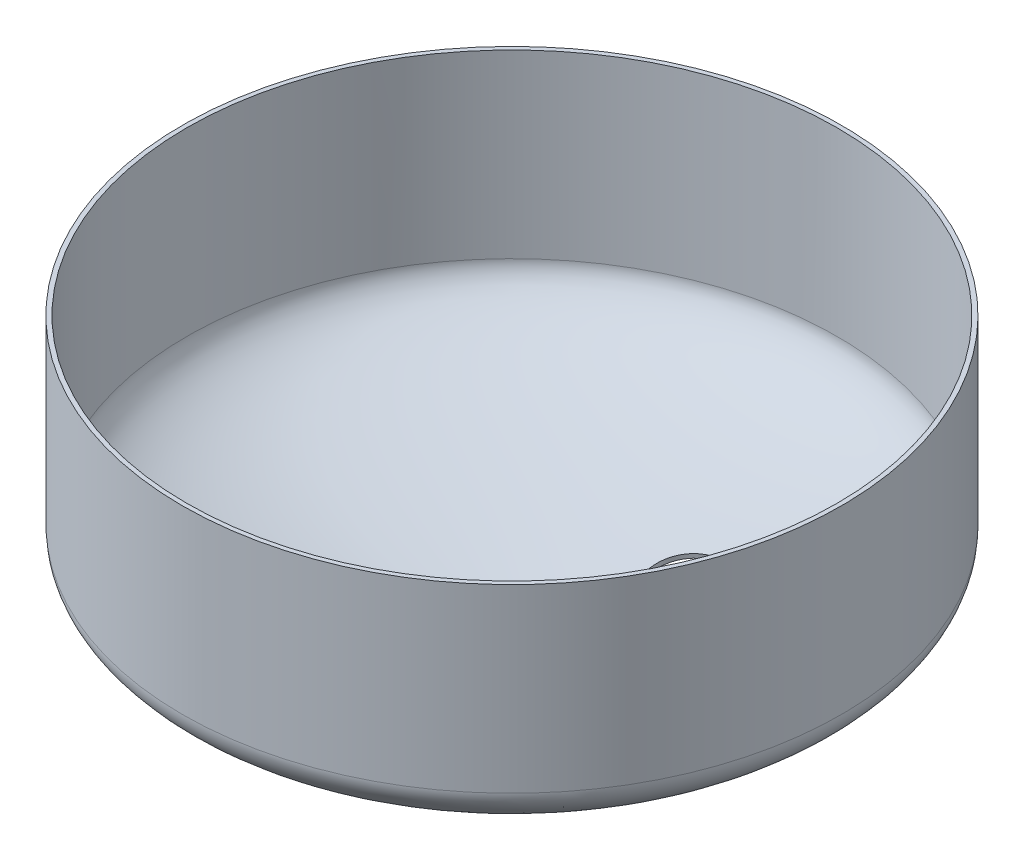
from build123d import *

# Parameters (mm, degrees)
WANDUNG1_T              = -2.5
SKIZZE2_R               = 9.25
LINEAR_AUSTRAGEN1_DEPTH = 316.317300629
SKIZZE3_R               = 20
LINEAR_AUSTRAGEN2_DEPTH = 10


with BuildPart() as part:
    # Skizze1 → Rotation1 (revolve)
    with BuildSketch(Plane(origin=(0, 0, 0), x_dir=(0, 0, -1), z_dir=(1, 0, 0)), mode=Mode.PRIVATE) as rotation1_sk:
        with BuildLine():
            Line((190, 165), (0, 165))
            Line((0, 165), (0, 0))
            Line((0, 0), (30, 0))
            add(Edge.make_bspline(
                [(30, 0), (190, 22.232846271), (190, 60.799834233)],
                knots=[5.326795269, 5.326795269, 5.326795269, 6.283185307, 6.283185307, 6.283185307], degree=2, weights=[1, 0.88782698, 1]))
            Line((190, 60.799834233), (190, 165))
        make_face()
    revolve(rotation1_sk.sketch.rotate(Axis((0, 182.531914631, 0), (0, -1, 0)), 180), axis=Axis((0, 182.531914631, 0), (0, -1, 0)))

    # Wandung1
    wandung1_openings = [part.faces().sort_by_distance(p)[0] for p in [
        (0, 165, 0),
    ]]
    offset(amount=WANDUNG1_T, openings=wandung1_openings, kind=Kind.INTERSECTION)

    # Skizze2 → Linear austragen1 (cut, through all)
    with BuildSketch(Plane.XZ):
        with Locations(Location((0, 0, 0), (0, 0, 270))):
            Circle(SKIZZE2_R)
    extrude(amount=-LINEAR_AUSTRAGEN1_DEPTH, mode=Mode.SUBTRACT)

    # Skizze3 → Linear austragen2 (cut)
    with BuildSketch(Plane(origin=(0.261122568, -6.956191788, -0.609285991), x_dir=(0.9972071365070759, 0.07440067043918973, 0.006516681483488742), z_dir=(-0.07440067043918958, 0.9820015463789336, 0.17360156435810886))):
        with Locations(Location((30.28394155, 70.662530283, 0), (0, 0, 89.625581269))):
            Circle(SKIZZE3_R)
    extrude(amount=LINEAR_AUSTRAGEN2_DEPTH, mode=Mode.SUBTRACT)


solid = part.part
